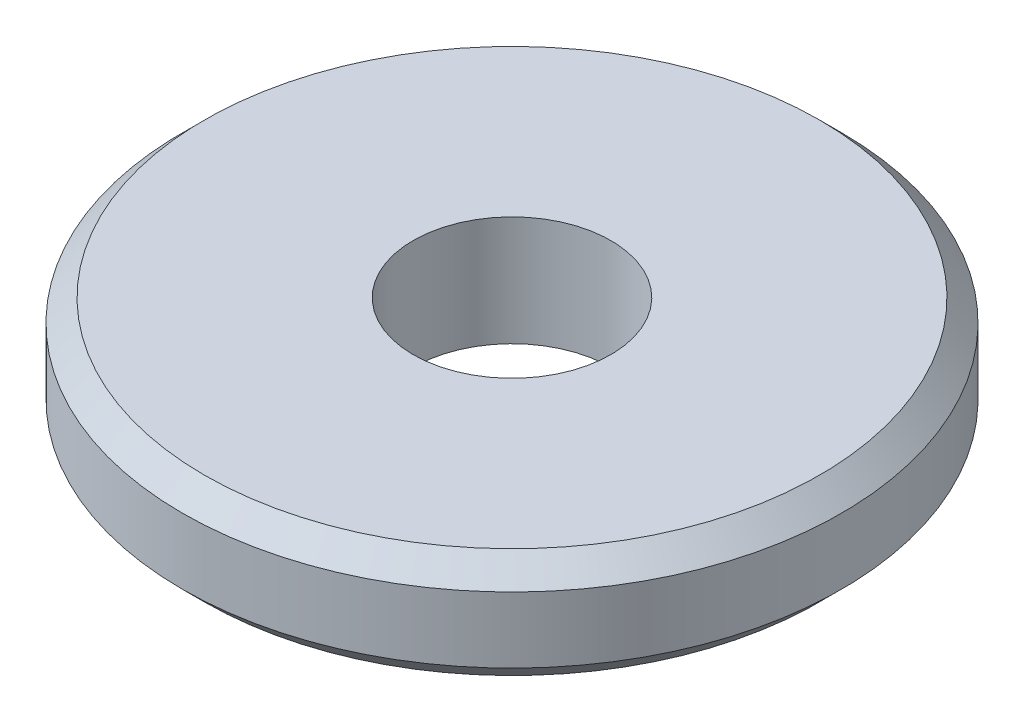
from build123d import *

# Parameters (mm, degrees)
SKETCH1_R      = 15
SKETCH1_R_2    = 4.5
EXTRUDE1_DEPTH = 5
CHAMFER1_SIZE  = 1


with BuildPart() as part:
    # Sketch1 → Extrude1 (new body)
    with BuildSketch(Plane(origin=(0, 0, 0), x_dir=(1, 0, 0), z_dir=(0, 1, 0))):
        with Locations(Location((0, 0, 0), (0, 0, 270))):
            Circle(SKETCH1_R)
        with Locations(Location((0, 0, 0), (0, 0, 270))):
            Circle(SKETCH1_R_2, mode=Mode.SUBTRACT)
    extrude(amount=EXTRUDE1_DEPTH)

    # Chamfer1
    chamfer1_edges = [part.edges().sort_by_distance(p)[0] for p in [
        (0, 0, -15),
        (0, 5, -15),
    ]]
    chamfer(chamfer1_edges, length=CHAMFER1_SIZE)


solid = part.part
